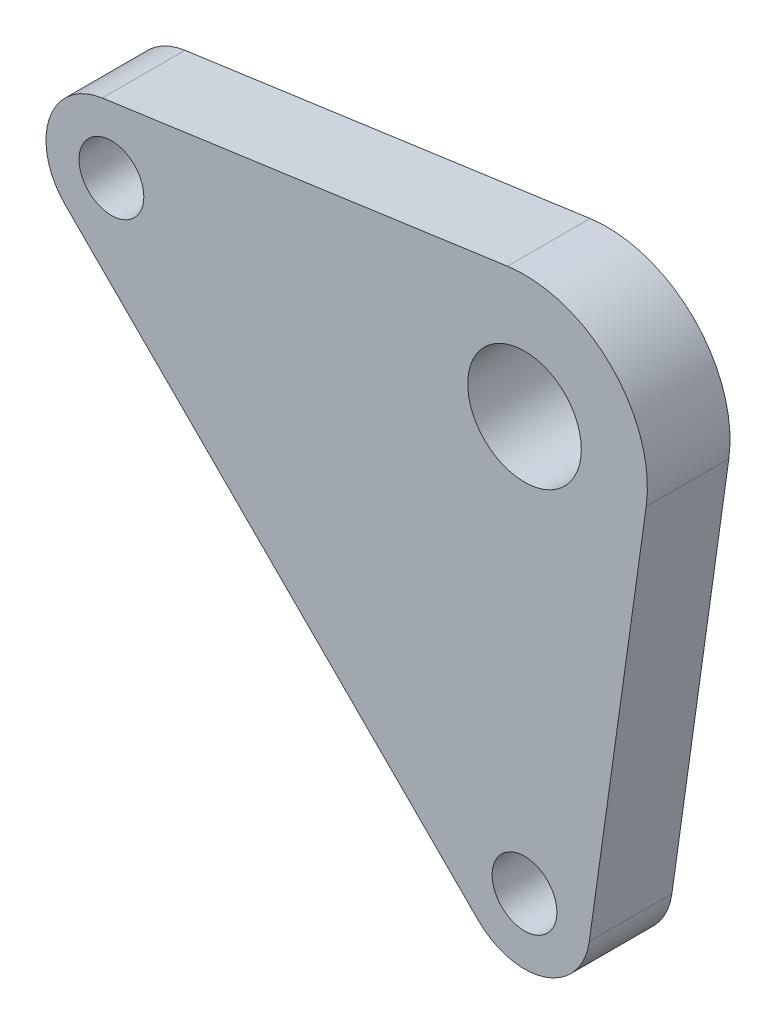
ISO-10303-21;
HEADER;
FILE_DESCRIPTION(('STEP AP214'),'2;1');
FILE_NAME('part.step','',(''),(''),'','','');
FILE_SCHEMA(('AUTOMOTIVE_DESIGN { 1 0 10303 214 1 1 1 1 }'));
ENDSEC;
DATA;
#1=APPLICATION_CONTEXT('core data for automotive mechanical design processes');
#2=APPLICATION_PROTOCOL_DEFINITION('international standard','automotive_design',2000,#1);
#3=PRODUCT_CONTEXT('',#1,'mechanical');
#4=PRODUCT('Part','Part','',(#3));
#5=PRODUCT_RELATED_PRODUCT_CATEGORY('part','',(#4));
#6=PRODUCT_DEFINITION_FORMATION('','',#4);
#7=PRODUCT_DEFINITION_CONTEXT('part definition',#1,'design');
#8=PRODUCT_DEFINITION('design','',#6,#7);
#9=PRODUCT_DEFINITION_SHAPE('','',#8);
#10=(LENGTH_UNIT() NAMED_UNIT(*) SI_UNIT(.MILLI.,.METRE.));
#11=(NAMED_UNIT(*) PLANE_ANGLE_UNIT() SI_UNIT($,.RADIAN.));
#12=(NAMED_UNIT(*) SI_UNIT($,.STERADIAN.) SOLID_ANGLE_UNIT());
#13=UNCERTAINTY_MEASURE_WITH_UNIT(LENGTH_MEASURE(1.E-05),#10,'distance_accuracy_value','');
#14=(GEOMETRIC_REPRESENTATION_CONTEXT(3) GLOBAL_UNCERTAINTY_ASSIGNED_CONTEXT((#13)) GLOBAL_UNIT_ASSIGNED_CONTEXT((#10,
#11,#12)) REPRESENTATION_CONTEXT('',''));
#15=CARTESIAN_POINT('',(0.,0.,0.));
#16=DIRECTION('',(0.,0.,1.));
#17=DIRECTION('',(1.,0.,0.));
#18=AXIS2_PLACEMENT_3D('',#15,#16,#17);
#19=CARTESIAN_POINT('',(-31.75,0.,6.35));
#20=DIRECTION('',(0.,0.,1.));
#21=DIRECTION('',(1.,0.,0.));
#22=AXIS2_PLACEMENT_3D('',#19,#20,#21);
#23=PLANE('',#22);
#24=CARTESIAN_POINT('',(-31.75,0.,6.35));
#25=DIRECTION('',(0.,0.,1.));
#26=DIRECTION('',(1.,0.,0.));
#27=AXIS2_PLACEMENT_3D('',#24,#25,#26);
#28=CIRCLE('',#27,2.4892);
#29=CARTESIAN_POINT('',(-29.2608,0.,6.35));
#30=VERTEX_POINT('',#29);
#31=EDGE_CURVE('E150',#30,#30,#28,.T.);
#32=ORIENTED_EDGE('',*,*,#31,.F.);
#33=EDGE_LOOP('',(#32));
#34=FACE_BOUND('',#33,.T.);
#35=CARTESIAN_POINT('',(-31.75,0.,6.35));
#36=DIRECTION('',(0.,0.,1.));
#37=DIRECTION('',(1.,0.,0.));
#38=AXIS2_PLACEMENT_3D('',#35,#36,#37);
#39=CIRCLE('',#38,5.02920000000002);
#40=CARTESIAN_POINT('',(-32.44956172,4.98030782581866,6.35));
#41=VERTEX_POINT('',#40);
#42=CARTESIAN_POINT('',(-35.3061814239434,-3.55618142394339,6.35));
#43=VERTEX_POINT('',#42);
#44=EDGE_CURVE('E86',#41,#43,#39,.T.);
#45=ORIENTED_EDGE('',*,*,#44,.T.);
#46=DIRECTION('',(0.707106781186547,-0.707106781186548,0.));
#47=VECTOR('',#46,1.);
#48=CARTESIAN_POINT('',(-3.5561814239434,-35.3061814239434,6.35));
#49=LINE('',#48,#47);
#50=CARTESIAN_POINT('',(-3.5561814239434,-35.3061814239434,6.35));
#51=VERTEX_POINT('',#50);
#52=EDGE_CURVE('E143',#43,#51,#49,.T.);
#53=ORIENTED_EDGE('',*,*,#52,.T.);
#54=CARTESIAN_POINT('',(0.,-31.75,6.35));
#55=DIRECTION('',(0.,0.,1.));
#56=DIRECTION('',(1.,0.,0.));
#57=AXIS2_PLACEMENT_3D('',#54,#55,#56);
#58=CIRCLE('',#57,5.02920000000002);
#59=CARTESIAN_POINT('',(4.98030782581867,-32.44956172,6.35));
#60=VERTEX_POINT('',#59);
#61=EDGE_CURVE('E100',#51,#60,#58,.T.);
#62=ORIENTED_EDGE('',*,*,#61,.T.);
#63=DIRECTION('',(0.1391,0.990278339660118,0.));
#64=VECTOR('',#63,1.);
#65=CARTESIAN_POINT('',(9.35379784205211,-1.3138864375,6.35));
#66=LINE('',#65,#64);
#67=CARTESIAN_POINT('',(9.35379784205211,-1.3138864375,6.35));
#68=VERTEX_POINT('',#67);
#69=EDGE_CURVE('E94',#60,#68,#66,.T.);
#70=ORIENTED_EDGE('',*,*,#69,.T.);
#71=CARTESIAN_POINT('',(0.,0.,6.35));
#72=DIRECTION('',(0.,0.,1.));
#73=DIRECTION('',(1.,0.,0.));
#74=AXIS2_PLACEMENT_3D('',#71,#72,#73);
#75=CIRCLE('',#74,9.44562500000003);
#76=CARTESIAN_POINT('',(-1.3138864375,9.35379784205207,6.35));
#77=VERTEX_POINT('',#76);
#78=EDGE_CURVE('E98',#68,#77,#75,.T.);
#79=ORIENTED_EDGE('',*,*,#78,.T.);
#80=DIRECTION('',(-0.990278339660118,-0.1391,0.));
#81=VECTOR('',#80,1.);
#82=CARTESIAN_POINT('',(-32.44956172,4.98030782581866,6.35));
#83=LINE('',#82,#81);
#84=EDGE_CURVE('E50',#77,#41,#83,.T.);
#85=ORIENTED_EDGE('',*,*,#84,.T.);
#86=EDGE_LOOP('',(#45,#53,#62,#70,#79,#85));
#87=FACE_BOUND('',#86,.T.);
#88=CARTESIAN_POINT('',(0.,0.,6.35));
#89=DIRECTION('',(0.,0.,1.));
#90=DIRECTION('',(1.,0.,0.));
#91=AXIS2_PLACEMENT_3D('',#88,#89,#90);
#92=CIRCLE('',#91,4.365625);
#93=CARTESIAN_POINT('',(4.365625,0.,6.35));
#94=VERTEX_POINT('',#93);
#95=EDGE_CURVE('E120',#94,#94,#92,.T.);
#96=ORIENTED_EDGE('',*,*,#95,.F.);
#97=EDGE_LOOP('',(#96));
#98=FACE_BOUND('',#97,.T.);
#99=CARTESIAN_POINT('',(0.,-31.75,6.35));
#100=DIRECTION('',(0.,0.,1.));
#101=DIRECTION('',(1.,0.,0.));
#102=AXIS2_PLACEMENT_3D('',#99,#100,#101);
#103=CIRCLE('',#102,2.4892);
#104=CARTESIAN_POINT('',(2.4892,-31.75,6.35));
#105=VERTEX_POINT('',#104);
#106=EDGE_CURVE('E156',#105,#105,#103,.T.);
#107=ORIENTED_EDGE('',*,*,#106,.F.);
#108=EDGE_LOOP('',(#107));
#109=FACE_BOUND('',#108,.T.);
#110=ADVANCED_FACE('F33',(#34,#87,#98,#109),#23,.T.);
#111=CARTESIAN_POINT('',(-31.75,0.,0.));
#112=DIRECTION('',(0.,0.,1.));
#113=DIRECTION('',(1.,0.,0.));
#114=AXIS2_PLACEMENT_3D('',#111,#112,#113);
#115=PLANE('',#114);
#116=CARTESIAN_POINT('',(-31.75,0.,0.));
#117=DIRECTION('',(0.,0.,1.));
#118=DIRECTION('',(1.,0.,0.));
#119=AXIS2_PLACEMENT_3D('',#116,#117,#118);
#120=CIRCLE('',#119,5.0292);
#121=CARTESIAN_POINT('',(-32.44956172,4.98030782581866,0.));
#122=VERTEX_POINT('',#121);
#123=CARTESIAN_POINT('',(-35.3061814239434,-3.55618142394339,0.));
#124=VERTEX_POINT('',#123);
#125=EDGE_CURVE('E80',#122,#124,#120,.T.);
#126=ORIENTED_EDGE('',*,*,#125,.F.);
#127=DIRECTION('',(-0.990278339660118,-0.1391,0.));
#128=VECTOR('',#127,1.);
#129=CARTESIAN_POINT('',(-32.44956172,4.98030782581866,0.));
#130=LINE('',#129,#128);
#131=CARTESIAN_POINT('',(-1.3138864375,9.35379784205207,0.));
#132=VERTEX_POINT('',#131);
#133=EDGE_CURVE('E126',#132,#122,#130,.T.);
#134=ORIENTED_EDGE('',*,*,#133,.F.);
#135=CARTESIAN_POINT('',(0.,0.,0.));
#136=DIRECTION('',(0.,0.,1.));
#137=DIRECTION('',(1.,0.,0.));
#138=AXIS2_PLACEMENT_3D('',#135,#136,#137);
#139=CIRCLE('',#138,9.44562500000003);
#140=CARTESIAN_POINT('',(9.35379784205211,-1.3138864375,0.));
#141=VERTEX_POINT('',#140);
#142=EDGE_CURVE('E73',#141,#132,#139,.T.);
#143=ORIENTED_EDGE('',*,*,#142,.F.);
#144=DIRECTION('',(0.1391,0.990278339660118,0.));
#145=VECTOR('',#144,1.);
#146=CARTESIAN_POINT('',(9.35379784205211,-1.3138864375,0.));
#147=LINE('',#146,#145);
#148=CARTESIAN_POINT('',(4.98030782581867,-32.44956172,0.));
#149=VERTEX_POINT('',#148);
#150=EDGE_CURVE('E108',#149,#141,#147,.T.);
#151=ORIENTED_EDGE('',*,*,#150,.F.);
#152=CARTESIAN_POINT('',(0.,-31.75,0.));
#153=DIRECTION('',(0.,0.,1.));
#154=DIRECTION('',(1.,0.,0.));
#155=AXIS2_PLACEMENT_3D('',#152,#153,#154);
#156=CIRCLE('',#155,5.02920000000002);
#157=CARTESIAN_POINT('',(-3.5561814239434,-35.3061814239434,0.));
#158=VERTEX_POINT('',#157);
#159=EDGE_CURVE('E122',#158,#149,#156,.T.);
#160=ORIENTED_EDGE('',*,*,#159,.F.);
#161=DIRECTION('',(0.707106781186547,-0.707106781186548,0.));
#162=VECTOR('',#161,1.);
#163=CARTESIAN_POINT('',(-3.5561814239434,-35.3061814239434,0.));
#164=LINE('',#163,#162);
#165=EDGE_CURVE('E119',#124,#158,#164,.T.);
#166=ORIENTED_EDGE('',*,*,#165,.F.);
#167=EDGE_LOOP('',(#126,#134,#143,#151,#160,#166));
#168=FACE_BOUND('',#167,.T.);
#169=CARTESIAN_POINT('',(0.,0.,0.));
#170=DIRECTION('',(0.,0.,1.));
#171=DIRECTION('',(1.,0.,0.));
#172=AXIS2_PLACEMENT_3D('',#169,#170,#171);
#173=CIRCLE('',#172,4.365625);
#174=CARTESIAN_POINT('',(4.365625,0.,0.));
#175=VERTEX_POINT('',#174);
#176=EDGE_CURVE('E147',#175,#175,#173,.T.);
#177=ORIENTED_EDGE('',*,*,#176,.T.);
#178=EDGE_LOOP('',(#177));
#179=FACE_BOUND('',#178,.T.);
#180=CARTESIAN_POINT('',(-31.75,0.,0.));
#181=DIRECTION('',(0.,0.,1.));
#182=DIRECTION('',(1.,0.,0.));
#183=AXIS2_PLACEMENT_3D('',#180,#181,#182);
#184=CIRCLE('',#183,2.4892);
#185=CARTESIAN_POINT('',(-29.2608,0.,0.));
#186=VERTEX_POINT('',#185);
#187=EDGE_CURVE('E153',#186,#186,#184,.T.);
#188=ORIENTED_EDGE('',*,*,#187,.T.);
#189=EDGE_LOOP('',(#188));
#190=FACE_BOUND('',#189,.T.);
#191=CARTESIAN_POINT('',(0.,-31.75,0.));
#192=DIRECTION('',(0.,0.,1.));
#193=DIRECTION('',(1.,0.,0.));
#194=AXIS2_PLACEMENT_3D('',#191,#192,#193);
#195=CIRCLE('',#194,2.4892);
#196=CARTESIAN_POINT('',(2.4892,-31.75,0.));
#197=VERTEX_POINT('',#196);
#198=EDGE_CURVE('E159',#197,#197,#195,.T.);
#199=ORIENTED_EDGE('',*,*,#198,.T.);
#200=EDGE_LOOP('',(#199));
#201=FACE_BOUND('',#200,.T.);
#202=ADVANCED_FACE('F138',(#168,#179,#190,#201),#115,.F.);
#203=CARTESIAN_POINT('',(-31.75,0.,6.35));
#204=DIRECTION('',(0.,0.,-1.));
#205=DIRECTION('',(-1.,0.,0.));
#206=AXIS2_PLACEMENT_3D('',#203,#204,#205);
#207=CYLINDRICAL_SURFACE('',#206,5.0292);
#208=ORIENTED_EDGE('',*,*,#125,.T.);
#209=DIRECTION('',(0.,0.,-1.));
#210=VECTOR('',#209,1.);
#211=CARTESIAN_POINT('',(-35.3061814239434,-3.55618142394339,6.35));
#212=LINE('',#211,#210);
#213=EDGE_CURVE('E11',#43,#124,#212,.T.);
#214=ORIENTED_EDGE('',*,*,#213,.F.);
#215=ORIENTED_EDGE('',*,*,#44,.F.);
#216=DIRECTION('',(0.,0.,-1.));
#217=VECTOR('',#216,1.);
#218=CARTESIAN_POINT('',(-32.44956172,4.98030782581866,6.35));
#219=LINE('',#218,#217);
#220=EDGE_CURVE('E114',#41,#122,#219,.T.);
#221=ORIENTED_EDGE('',*,*,#220,.T.);
#222=EDGE_LOOP('',(#208,#214,#215,#221));
#223=FACE_BOUND('',#222,.T.);
#224=ADVANCED_FACE('F35',(#223),#207,.T.);
#225=CARTESIAN_POINT('',(-3.5561814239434,-35.3061814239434,6.35));
#226=DIRECTION('',(0.707106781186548,0.707106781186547,0.));
#227=DIRECTION('',(-0.707106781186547,0.707106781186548,0.));
#228=AXIS2_PLACEMENT_3D('',#225,#226,#227);
#229=PLANE('',#228);
#230=ORIENTED_EDGE('',*,*,#165,.T.);
#231=DIRECTION('',(0.,0.,-1.));
#232=VECTOR('',#231,1.);
#233=CARTESIAN_POINT('',(-3.5561814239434,-35.3061814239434,6.35));
#234=LINE('',#233,#232);
#235=EDGE_CURVE('E42',#51,#158,#234,.T.);
#236=ORIENTED_EDGE('',*,*,#235,.F.);
#237=ORIENTED_EDGE('',*,*,#52,.F.);
#238=ORIENTED_EDGE('',*,*,#213,.T.);
#239=EDGE_LOOP('',(#230,#236,#237,#238));
#240=FACE_BOUND('',#239,.T.);
#241=ADVANCED_FACE('F187',(#240),#229,.F.);
#242=CARTESIAN_POINT('',(0.,-31.75,6.35));
#243=DIRECTION('',(0.,0.,-1.));
#244=DIRECTION('',(-1.,0.,0.));
#245=AXIS2_PLACEMENT_3D('',#242,#243,#244);
#246=CYLINDRICAL_SURFACE('',#245,5.02920000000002);
#247=ORIENTED_EDGE('',*,*,#159,.T.);
#248=DIRECTION('',(0.,0.,-1.));
#249=VECTOR('',#248,1.);
#250=CARTESIAN_POINT('',(4.98030782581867,-32.44956172,6.35));
#251=LINE('',#250,#249);
#252=EDGE_CURVE('E109',#60,#149,#251,.T.);
#253=ORIENTED_EDGE('',*,*,#252,.F.);
#254=ORIENTED_EDGE('',*,*,#61,.F.);
#255=ORIENTED_EDGE('',*,*,#235,.T.);
#256=EDGE_LOOP('',(#247,#253,#254,#255));
#257=FACE_BOUND('',#256,.T.);
#258=ADVANCED_FACE('F135',(#257),#246,.T.);
#259=CARTESIAN_POINT('',(9.35379784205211,-1.3138864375,6.35));
#260=DIRECTION('',(-0.990278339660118,0.1391,0.));
#261=DIRECTION('',(-0.1391,-0.990278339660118,0.));
#262=AXIS2_PLACEMENT_3D('',#259,#260,#261);
#263=PLANE('',#262);
#264=ORIENTED_EDGE('',*,*,#150,.T.);
#265=DIRECTION('',(0.,0.,-1.));
#266=VECTOR('',#265,1.);
#267=CARTESIAN_POINT('',(9.35379784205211,-1.3138864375,6.35));
#268=LINE('',#267,#266);
#269=EDGE_CURVE('E105',#68,#141,#268,.T.);
#270=ORIENTED_EDGE('',*,*,#269,.F.);
#271=ORIENTED_EDGE('',*,*,#69,.F.);
#272=ORIENTED_EDGE('',*,*,#252,.T.);
#273=EDGE_LOOP('',(#264,#270,#271,#272));
#274=FACE_BOUND('',#273,.T.);
#275=ADVANCED_FACE('F106',(#274),#263,.F.);
#276=CARTESIAN_POINT('',(0.,0.,6.35));
#277=DIRECTION('',(0.,0.,-1.));
#278=DIRECTION('',(-1.,0.,0.));
#279=AXIS2_PLACEMENT_3D('',#276,#277,#278);
#280=CYLINDRICAL_SURFACE('',#279,9.44562500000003);
#281=ORIENTED_EDGE('',*,*,#142,.T.);
#282=DIRECTION('',(0.,0.,-1.));
#283=VECTOR('',#282,1.);
#284=CARTESIAN_POINT('',(-1.3138864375,9.35379784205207,6.35));
#285=LINE('',#284,#283);
#286=EDGE_CURVE('E110',#77,#132,#285,.T.);
#287=ORIENTED_EDGE('',*,*,#286,.F.);
#288=ORIENTED_EDGE('',*,*,#78,.F.);
#289=ORIENTED_EDGE('',*,*,#269,.T.);
#290=EDGE_LOOP('',(#281,#287,#288,#289));
#291=FACE_BOUND('',#290,.T.);
#292=ADVANCED_FACE('F112',(#291),#280,.T.);
#293=CARTESIAN_POINT('',(-32.44956172,4.98030782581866,6.35));
#294=DIRECTION('',(0.1391,-0.990278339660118,0.));
#295=DIRECTION('',(0.990278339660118,0.1391,0.));
#296=AXIS2_PLACEMENT_3D('',#293,#294,#295);
#297=PLANE('',#296);
#298=ORIENTED_EDGE('',*,*,#133,.T.);
#299=ORIENTED_EDGE('',*,*,#220,.F.);
#300=ORIENTED_EDGE('',*,*,#84,.F.);
#301=ORIENTED_EDGE('',*,*,#286,.T.);
#302=EDGE_LOOP('',(#298,#299,#300,#301));
#303=FACE_BOUND('',#302,.T.);
#304=ADVANCED_FACE('F141',(#303),#297,.F.);
#305=CARTESIAN_POINT('',(0.,0.,6.35));
#306=DIRECTION('',(0.,0.,-1.));
#307=DIRECTION('',(-1.,0.,0.));
#308=AXIS2_PLACEMENT_3D('',#305,#306,#307);
#309=CYLINDRICAL_SURFACE('',#308,4.365625);
#310=ORIENTED_EDGE('',*,*,#95,.T.);
#311=EDGE_LOOP('',(#310));
#312=FACE_BOUND('',#311,.T.);
#313=ORIENTED_EDGE('',*,*,#176,.F.);
#314=EDGE_LOOP('',(#313));
#315=FACE_BOUND('',#314,.T.);
#316=ADVANCED_FACE('F177',(#312,#315),#309,.F.);
#317=CARTESIAN_POINT('',(-31.75,0.,6.35));
#318=DIRECTION('',(0.,0.,-1.));
#319=DIRECTION('',(-1.,0.,0.));
#320=AXIS2_PLACEMENT_3D('',#317,#318,#319);
#321=CYLINDRICAL_SURFACE('',#320,2.4892);
#322=ORIENTED_EDGE('',*,*,#31,.T.);
#323=EDGE_LOOP('',(#322));
#324=FACE_BOUND('',#323,.T.);
#325=ORIENTED_EDGE('',*,*,#187,.F.);
#326=EDGE_LOOP('',(#325));
#327=FACE_BOUND('',#326,.T.);
#328=ADVANCED_FACE('F241',(#324,#327),#321,.F.);
#329=CARTESIAN_POINT('',(0.,-31.75,6.35));
#330=DIRECTION('',(0.,0.,-1.));
#331=DIRECTION('',(-1.,0.,0.));
#332=AXIS2_PLACEMENT_3D('',#329,#330,#331);
#333=CYLINDRICAL_SURFACE('',#332,2.4892);
#334=ORIENTED_EDGE('',*,*,#106,.T.);
#335=EDGE_LOOP('',(#334));
#336=FACE_BOUND('',#335,.T.);
#337=ORIENTED_EDGE('',*,*,#198,.F.);
#338=EDGE_LOOP('',(#337));
#339=FACE_BOUND('',#338,.T.);
#340=ADVANCED_FACE('F165',(#336,#339),#333,.F.);
#341=CLOSED_SHELL('',(#110,#202,#224,#241,#258,#275,#292,#304,#316,#328,#340));
#342=MANIFOLD_SOLID_BREP('B2',#341);
#343=ADVANCED_BREP_SHAPE_REPRESENTATION('',(#18,#342),#14);
#344=SHAPE_DEFINITION_REPRESENTATION(#9,#343);
ENDSEC;
END-ISO-10303-21;
